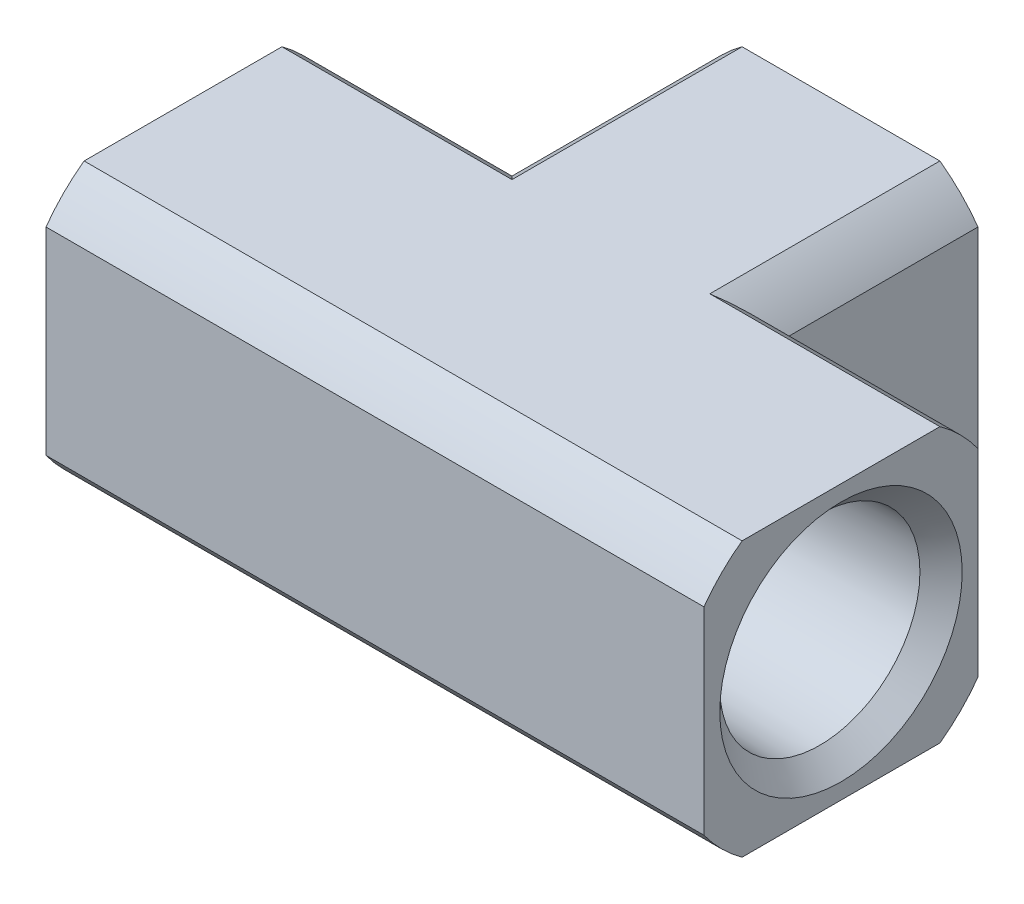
ISO-10303-21;
HEADER;
FILE_DESCRIPTION(('STEP AP214'),'2;1');
FILE_NAME('part.step','',(''),(''),'','','');
FILE_SCHEMA(('AUTOMOTIVE_DESIGN { 1 0 10303 214 1 1 1 1 }'));
ENDSEC;
DATA;
#1=APPLICATION_CONTEXT('core data for automotive mechanical design processes');
#2=APPLICATION_PROTOCOL_DEFINITION('international standard','automotive_design',2000,#1);
#3=PRODUCT_CONTEXT('',#1,'mechanical');
#4=PRODUCT('Part','Part','',(#3));
#5=PRODUCT_RELATED_PRODUCT_CATEGORY('part','',(#4));
#6=PRODUCT_DEFINITION_FORMATION('','',#4);
#7=PRODUCT_DEFINITION_CONTEXT('part definition',#1,'design');
#8=PRODUCT_DEFINITION('design','',#6,#7);
#9=PRODUCT_DEFINITION_SHAPE('','',#8);
#10=(LENGTH_UNIT() NAMED_UNIT(*) SI_UNIT(.MILLI.,.METRE.));
#11=(NAMED_UNIT(*) PLANE_ANGLE_UNIT() SI_UNIT($,.RADIAN.));
#12=(NAMED_UNIT(*) SI_UNIT($,.STERADIAN.) SOLID_ANGLE_UNIT());
#13=UNCERTAINTY_MEASURE_WITH_UNIT(LENGTH_MEASURE(1.E-05),#10,'distance_accuracy_value','');
#14=(GEOMETRIC_REPRESENTATION_CONTEXT(3) GLOBAL_UNCERTAINTY_ASSIGNED_CONTEXT((#13)) GLOBAL_UNIT_ASSIGNED_CONTEXT((#10,
#11,#12)) REPRESENTATION_CONTEXT('',''));
#15=CARTESIAN_POINT('',(0.,0.,0.));
#16=DIRECTION('',(0.,0.,1.));
#17=DIRECTION('',(1.,0.,0.));
#18=AXIS2_PLACEMENT_3D('',#15,#16,#17);
#19=CARTESIAN_POINT('',(5.08,0.,0.));
#20=DIRECTION('',(-1.,0.,0.));
#21=DIRECTION('',(0.,0.,1.));
#22=AXIS2_PLACEMENT_3D('',#19,#20,#21);
#23=CYLINDRICAL_SURFACE('',#22,5.3594);
#24=CARTESIAN_POINT('',(5.08,0.,0.));
#25=DIRECTION('',(-1.,0.,0.));
#26=DIRECTION('',(0.,0.,1.));
#27=AXIS2_PLACEMENT_3D('',#24,#25,#26);
#28=CIRCLE('',#27,5.3594);
#29=CARTESIAN_POINT('',(5.08,1.70785490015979,-5.08));
#30=VERTEX_POINT('',#29);
#31=CARTESIAN_POINT('',(5.08,-1.70785490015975,-5.08));
#32=VERTEX_POINT('',#31);
#33=EDGE_CURVE('E165',#30,#32,#28,.F.);
#34=ORIENTED_EDGE('',*,*,#33,.T.);
#35=CARTESIAN_POINT('',(0.,0.,0.));
#36=DIRECTION('',(-0.707106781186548,0.,-0.707106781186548));
#37=DIRECTION('',(-0.707106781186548,0.,0.707106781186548));
#38=AXIS2_PLACEMENT_3D('',#35,#36,#37);
#39=ELLIPSE('',#38,7.57933616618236,5.3594);
#40=CARTESIAN_POINT('',(0.,-5.3594,0.));
#41=VERTEX_POINT('',#40);
#42=EDGE_CURVE('E196',#32,#41,#39,.T.);
#43=ORIENTED_EDGE('',*,*,#42,.T.);
#44=CARTESIAN_POINT('',(0.,0.,0.));
#45=DIRECTION('',(-0.707106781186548,0.,0.707106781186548));
#46=DIRECTION('',(-0.707106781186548,0.,-0.707106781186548));
#47=AXIS2_PLACEMENT_3D('',#44,#45,#46);
#48=ELLIPSE('',#47,7.57933616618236,5.3594);
#49=CARTESIAN_POINT('',(-5.08,-1.70785490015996,-5.08));
#50=VERTEX_POINT('',#49);
#51=EDGE_CURVE('E160',#41,#50,#48,.F.);
#52=ORIENTED_EDGE('',*,*,#51,.T.);
#53=CARTESIAN_POINT('',(-5.08,0.,0.));
#54=DIRECTION('',(-1.,0.,0.));
#55=DIRECTION('',(0.,0.,1.));
#56=AXIS2_PLACEMENT_3D('',#53,#54,#55);
#57=CIRCLE('',#56,5.3594);
#58=CARTESIAN_POINT('',(-5.08,1.70785490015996,-5.08));
#59=VERTEX_POINT('',#58);
#60=EDGE_CURVE('E156',#50,#59,#57,.T.);
#61=ORIENTED_EDGE('',*,*,#60,.T.);
#62=CARTESIAN_POINT('',(0.,0.,0.));
#63=DIRECTION('',(-0.707106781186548,0.,0.707106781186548));
#64=DIRECTION('',(-0.707106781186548,0.,-0.707106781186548));
#65=AXIS2_PLACEMENT_3D('',#62,#63,#64);
#66=ELLIPSE('',#65,7.57933616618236,5.3594);
#67=CARTESIAN_POINT('',(0.,5.3594,0.));
#68=VERTEX_POINT('',#67);
#69=EDGE_CURVE('E19',#59,#68,#66,.F.);
#70=ORIENTED_EDGE('',*,*,#69,.T.);
#71=CARTESIAN_POINT('',(0.,0.,0.));
#72=DIRECTION('',(-0.707106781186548,0.,-0.707106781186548));
#73=DIRECTION('',(-0.707106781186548,0.,0.707106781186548));
#74=AXIS2_PLACEMENT_3D('',#71,#72,#73);
#75=ELLIPSE('',#74,7.57933616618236,5.3594);
#76=EDGE_CURVE('E174',#68,#30,#75,.T.);
#77=ORIENTED_EDGE('',*,*,#76,.T.);
#78=EDGE_LOOP('',(#34,#43,#52,#61,#70,#77));
#79=FACE_BOUND('',#78,.T.);
#80=ADVANCED_FACE('F15',(#79),#23,.F.);
#81=CARTESIAN_POINT('',(0.,0.,-5.0800000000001));
#82=DIRECTION('',(0.,0.,1.));
#83=DIRECTION('',(1.,0.,0.));
#84=AXIS2_PLACEMENT_3D('',#81,#82,#83);
#85=CYLINDRICAL_SURFACE('',#84,5.3594);
#86=ORIENTED_EDGE('',*,*,#76,.F.);
#87=ORIENTED_EDGE('',*,*,#69,.F.);
#88=CARTESIAN_POINT('',(0.,0.,-5.08));
#89=DIRECTION('',(0.,0.,1.));
#90=DIRECTION('',(1.,0.,0.));
#91=AXIS2_PLACEMENT_3D('',#88,#89,#90);
#92=CIRCLE('',#91,5.3594);
#93=EDGE_CURVE('E172',#59,#30,#92,.F.);
#94=ORIENTED_EDGE('',*,*,#93,.T.);
#95=EDGE_LOOP('',(#86,#87,#94));
#96=FACE_BOUND('',#95,.T.);
#97=ADVANCED_FACE('F170',(#96),#85,.F.);
#98=CARTESIAN_POINT('',(0.,0.,-5.0800000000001));
#99=DIRECTION('',(0.,0.,1.));
#100=DIRECTION('',(1.,0.,0.));
#101=AXIS2_PLACEMENT_3D('',#98,#99,#100);
#102=CYLINDRICAL_SURFACE('',#101,5.3594);
#103=ORIENTED_EDGE('',*,*,#51,.F.);
#104=ORIENTED_EDGE('',*,*,#42,.F.);
#105=CARTESIAN_POINT('',(0.,0.,-5.08));
#106=DIRECTION('',(0.,0.,1.));
#107=DIRECTION('',(1.,0.,0.));
#108=AXIS2_PLACEMENT_3D('',#105,#106,#107);
#109=CIRCLE('',#108,5.3594);
#110=EDGE_CURVE('E192',#32,#50,#109,.F.);
#111=ORIENTED_EDGE('',*,*,#110,.T.);
#112=EDGE_LOOP('',(#103,#104,#111));
#113=FACE_BOUND('',#112,.T.);
#114=ADVANCED_FACE('F211',(#113),#102,.F.);
#115=CARTESIAN_POINT('',(-5.08,0.,0.));
#116=DIRECTION('',(1.,0.,0.));
#117=DIRECTION('',(0.,0.,-1.));
#118=AXIS2_PLACEMENT_3D('',#115,#116,#117);
#119=PLANE('',#118);
#120=DIRECTION('',(0.,-1.,0.));
#121=VECTOR('',#120,1.);
#122=CARTESIAN_POINT('',(-5.08,-3.67310032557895,-5.08));
#123=LINE('',#122,#121);
#124=CARTESIAN_POINT('',(-5.08,-2.3552529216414,-5.08));
#125=VERTEX_POINT('',#124);
#126=EDGE_CURVE('E214',#50,#125,#123,.T.);
#127=ORIENTED_EDGE('',*,*,#126,.T.);
#128=CARTESIAN_POINT('',(-5.08,0.,0.));
#129=DIRECTION('',(1.,0.,0.));
#130=DIRECTION('',(0.,0.,-1.));
#131=AXIS2_PLACEMENT_3D('',#128,#129,#130);
#132=CIRCLE('',#131,5.59943);
#133=CARTESIAN_POINT('',(-5.08,2.35525292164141,-5.08));
#134=VERTEX_POINT('',#133);
#135=EDGE_CURVE('E178',#125,#134,#132,.F.);
#136=ORIENTED_EDGE('',*,*,#135,.T.);
#137=DIRECTION('',(0.,-1.,0.));
#138=VECTOR('',#137,1.);
#139=CARTESIAN_POINT('',(-5.08000000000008,3.6731003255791,-5.08));
#140=LINE('',#139,#138);
#141=EDGE_CURVE('E176',#134,#59,#140,.T.);
#142=ORIENTED_EDGE('',*,*,#141,.T.);
#143=ORIENTED_EDGE('',*,*,#60,.F.);
#144=EDGE_LOOP('',(#127,#136,#142,#143));
#145=FACE_BOUND('',#144,.T.);
#146=ADVANCED_FACE('F177',(#145),#119,.F.);
#147=CARTESIAN_POINT('',(5.08,-5.59943,5.70622429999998));
#148=DIRECTION('',(-1.,0.,0.));
#149=DIRECTION('',(0.,1.,0.));
#150=AXIS2_PLACEMENT_3D('',#147,#148,#149);
#151=PLANE('',#150);
#152=ORIENTED_EDGE('',*,*,#33,.F.);
#153=DIRECTION('',(0.,1.,0.));
#154=VECTOR('',#153,1.);
#155=CARTESIAN_POINT('',(5.08,3.6731003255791,-5.08));
#156=LINE('',#155,#154);
#157=CARTESIAN_POINT('',(5.08,2.3552529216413,-5.08));
#158=VERTEX_POINT('',#157);
#159=EDGE_CURVE('E184',#30,#158,#156,.T.);
#160=ORIENTED_EDGE('',*,*,#159,.T.);
#161=CARTESIAN_POINT('',(5.08,0.,0.));
#162=DIRECTION('',(-1.,0.,0.));
#163=DIRECTION('',(0.,0.,1.));
#164=AXIS2_PLACEMENT_3D('',#161,#162,#163);
#165=CIRCLE('',#164,5.59943);
#166=CARTESIAN_POINT('',(5.08,-2.35525292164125,-5.08));
#167=VERTEX_POINT('',#166);
#168=EDGE_CURVE('E203',#158,#167,#165,.F.);
#169=ORIENTED_EDGE('',*,*,#168,.T.);
#170=DIRECTION('',(0.,1.,0.));
#171=VECTOR('',#170,1.);
#172=CARTESIAN_POINT('',(5.08,-3.67310032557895,-5.08));
#173=LINE('',#172,#171);
#174=EDGE_CURVE('E183',#167,#32,#173,.T.);
#175=ORIENTED_EDGE('',*,*,#174,.T.);
#176=EDGE_LOOP('',(#152,#160,#169,#175));
#177=FACE_BOUND('',#176,.T.);
#178=ADVANCED_FACE('F201',(#177),#151,.F.);
#179=CARTESIAN_POINT('',(5.08,5.63834575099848,-5.08));
#180=DIRECTION('',(0.,0.,1.));
#181=DIRECTION('',(-1.,0.,0.));
#182=AXIS2_PLACEMENT_3D('',#179,#180,#181);
#183=PLANE('',#182);
#184=CARTESIAN_POINT('',(0.,0.,-5.08));
#185=DIRECTION('',(0.,0.,1.));
#186=DIRECTION('',(1.,0.,0.));
#187=AXIS2_PLACEMENT_3D('',#184,#185,#186);
#188=CIRCLE('',#187,5.59943);
#189=EDGE_CURVE('E293',#134,#158,#188,.F.);
#190=ORIENTED_EDGE('',*,*,#189,.T.);
#191=ORIENTED_EDGE('',*,*,#159,.F.);
#192=ORIENTED_EDGE('',*,*,#93,.F.);
#193=ORIENTED_EDGE('',*,*,#141,.F.);
#194=EDGE_LOOP('',(#190,#191,#192,#193));
#195=FACE_BOUND('',#194,.T.);
#196=ADVANCED_FACE('F186',(#195),#183,.F.);
#197=CARTESIAN_POINT('',(5.08,-1.70785490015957,-5.08));
#198=DIRECTION('',(0.,0.,1.));
#199=DIRECTION('',(-1.,0.,0.));
#200=AXIS2_PLACEMENT_3D('',#197,#198,#199);
#201=PLANE('',#200);
#202=ORIENTED_EDGE('',*,*,#110,.F.);
#203=ORIENTED_EDGE('',*,*,#174,.F.);
#204=CARTESIAN_POINT('',(0.,0.,-5.08));
#205=DIRECTION('',(0.,0.,1.));
#206=DIRECTION('',(1.,0.,0.));
#207=AXIS2_PLACEMENT_3D('',#204,#205,#206);
#208=CIRCLE('',#207,5.59943);
#209=EDGE_CURVE('E289',#167,#125,#208,.F.);
#210=ORIENTED_EDGE('',*,*,#209,.T.);
#211=ORIENTED_EDGE('',*,*,#126,.F.);
#212=EDGE_LOOP('',(#202,#203,#210,#211));
#213=FACE_BOUND('',#212,.T.);
#214=ADVANCED_FACE('F213',(#213),#201,.F.);
#215=CARTESIAN_POINT('',(-12.192,0.,0.));
#216=DIRECTION('',(1.,0.,0.));
#217=DIRECTION('',(0.,0.,-1.));
#218=AXIS2_PLACEMENT_3D('',#215,#216,#217);
#219=CYLINDRICAL_SURFACE('',#218,5.59943);
#220=ORIENTED_EDGE('',*,*,#135,.F.);
#221=CARTESIAN_POINT('',(0.,0.,0.));
#222=DIRECTION('',(0.707106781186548,0.,-0.707106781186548));
#223=DIRECTION('',(0.707106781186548,0.,0.707106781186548));
#224=AXIS2_PLACEMENT_3D('',#221,#222,#223);
#225=ELLIPSE('',#224,7.91878984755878,5.59943);
#226=EDGE_CURVE('E287',#125,#134,#225,.T.);
#227=ORIENTED_EDGE('',*,*,#226,.T.);
#228=EDGE_LOOP('',(#220,#227));
#229=FACE_BOUND('',#228,.T.);
#230=CARTESIAN_POINT('',(-9.29340058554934,0.,0.));
#231=DIRECTION('',(-1.,0.,0.));
#232=DIRECTION('',(0.,-1.,0.));
#233=AXIS2_PLACEMENT_3D('',#230,#231,#232);
#234=CIRCLE('',#233,5.59943);
#235=CARTESIAN_POINT('',(-9.29340058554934,-5.59943,0.));
#236=VERTEX_POINT('',#235);
#237=EDGE_CURVE('E217',#236,#236,#234,.T.);
#238=ORIENTED_EDGE('',*,*,#237,.T.);
#239=EDGE_LOOP('',(#238));
#240=FACE_BOUND('',#239,.T.);
#241=ADVANCED_FACE('F303',(#229,#240),#219,.F.);
#242=CARTESIAN_POINT('',(9.29340058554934,0.,0.));
#243=DIRECTION('',(-1.,0.,0.));
#244=DIRECTION('',(0.,0.,1.));
#245=AXIS2_PLACEMENT_3D('',#242,#243,#244);
#246=CYLINDRICAL_SURFACE('',#245,5.59943);
#247=CARTESIAN_POINT('',(0.,0.,0.));
#248=DIRECTION('',(-0.707106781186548,0.,-0.707106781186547));
#249=DIRECTION('',(-0.707106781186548,0.,0.707106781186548));
#250=AXIS2_PLACEMENT_3D('',#247,#248,#249);
#251=ELLIPSE('',#250,7.91878984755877,5.59943);
#252=EDGE_CURVE('E291',#158,#167,#251,.T.);
#253=ORIENTED_EDGE('',*,*,#252,.T.);
#254=ORIENTED_EDGE('',*,*,#168,.F.);
#255=EDGE_LOOP('',(#253,#254));
#256=FACE_BOUND('',#255,.T.);
#257=CARTESIAN_POINT('',(9.29340058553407,0.,0.));
#258=DIRECTION('',(1.,0.,0.));
#259=DIRECTION('',(0.,0.,1.));
#260=AXIS2_PLACEMENT_3D('',#257,#258,#259);
#261=CIRCLE('',#260,5.59943000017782);
#262=CARTESIAN_POINT('',(9.29340058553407,0.,5.59943000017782));
#263=VERTEX_POINT('',#262);
#264=EDGE_CURVE('E310',#263,#263,#261,.T.);
#265=ORIENTED_EDGE('',*,*,#264,.T.);
#266=EDGE_LOOP('',(#265));
#267=FACE_BOUND('',#266,.T.);
#268=ADVANCED_FACE('F298',(#256,#267),#246,.F.);
#269=CARTESIAN_POINT('',(0.,0.,-9.2837));
#270=DIRECTION('',(0.,0.,1.));
#271=DIRECTION('',(1.,0.,0.));
#272=AXIS2_PLACEMENT_3D('',#269,#270,#271);
#273=CYLINDRICAL_SURFACE('',#272,5.59943);
#274=ORIENTED_EDGE('',*,*,#252,.F.);
#275=ORIENTED_EDGE('',*,*,#189,.F.);
#276=ORIENTED_EDGE('',*,*,#226,.F.);
#277=ORIENTED_EDGE('',*,*,#209,.F.);
#278=EDGE_LOOP('',(#274,#275,#276,#277));
#279=FACE_BOUND('',#278,.T.);
#280=CARTESIAN_POINT('',(0.,0.,-9.28369999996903));
#281=DIRECTION('',(0.,0.,-1.));
#282=DIRECTION('',(0.,-1.,0.));
#283=AXIS2_PLACEMENT_3D('',#280,#281,#282);
#284=CIRCLE('',#283,5.59943000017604);
#285=CARTESIAN_POINT('',(0.,-5.59943000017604,-9.28369999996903));
#286=VERTEX_POINT('',#285);
#287=EDGE_CURVE('E312',#286,#286,#284,.T.);
#288=ORIENTED_EDGE('',*,*,#287,.T.);
#289=EDGE_LOOP('',(#288));
#290=FACE_BOUND('',#289,.T.);
#291=ADVANCED_FACE('F300',(#279,#290),#273,.F.);
#292=CARTESIAN_POINT('',(-9.29340058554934,0.,0.));
#293=DIRECTION('',(-1.,0.,0.));
#294=DIRECTION('',(0.,-1.,0.));
#295=AXIS2_PLACEMENT_3D('',#292,#293,#294);
#296=CONICAL_SURFACE('',#295,5.59943,0.0311192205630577);
#297=ORIENTED_EDGE('',*,*,#237,.F.);
#298=EDGE_LOOP('',(#297));
#299=FACE_BOUND('',#298,.T.);
#300=CARTESIAN_POINT('',(-18.0644668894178,0.,0.));
#301=DIRECTION('',(-1.,0.,0.));
#302=DIRECTION('',(0.,0.,1.));
#303=AXIS2_PLACEMENT_3D('',#300,#301,#302);
#304=CIRCLE('',#303,5.87246688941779);
#305=CARTESIAN_POINT('',(-18.0644668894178,0.,5.87246688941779));
#306=VERTEX_POINT('',#305);
#307=EDGE_CURVE('E318',#306,#306,#304,.T.);
#308=ORIENTED_EDGE('',*,*,#307,.T.);
#309=EDGE_LOOP('',(#308));
#310=FACE_BOUND('',#309,.T.);
#311=ADVANCED_FACE('F645',(#299,#310),#296,.F.);
#312=CARTESIAN_POINT('',(18.0644668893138,0.,0.));
#313=DIRECTION('',(1.,0.,0.));
#314=DIRECTION('',(0.,0.,-1.));
#315=AXIS2_PLACEMENT_3D('',#312,#313,#314);
#316=CONICAL_SURFACE('',#315,5.87246688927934,0.0311192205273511);
#317=CARTESIAN_POINT('',(18.0644668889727,0.,0.));
#318=DIRECTION('',(1.,0.,0.));
#319=DIRECTION('',(0.,0.,1.));
#320=AXIS2_PLACEMENT_3D('',#317,#318,#319);
#321=CIRCLE('',#320,5.87246688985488);
#322=CARTESIAN_POINT('',(18.0644668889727,0.,5.87246688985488));
#323=VERTEX_POINT('',#322);
#324=EDGE_CURVE('E322',#323,#323,#321,.T.);
#325=ORIENTED_EDGE('',*,*,#324,.T.);
#326=EDGE_LOOP('',(#325));
#327=FACE_BOUND('',#326,.T.);
#328=ORIENTED_EDGE('',*,*,#264,.F.);
#329=EDGE_LOOP('',(#328));
#330=FACE_BOUND('',#329,.T.);
#331=ADVANCED_FACE('F654',(#327,#330),#316,.F.);
#332=CARTESIAN_POINT('',(0.,0.,-18.0647785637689));
#333=DIRECTION('',(0.,0.,-1.));
#334=DIRECTION('',(-1.,0.,0.));
#335=AXIS2_PLACEMENT_3D('',#332,#333,#334);
#336=CONICAL_SURFACE('',#335,5.87277856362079,0.0311192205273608);
#337=ORIENTED_EDGE('',*,*,#287,.F.);
#338=EDGE_LOOP('',(#337));
#339=FACE_BOUND('',#338,.T.);
#340=CARTESIAN_POINT('',(0.,0.,-18.0647785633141));
#341=DIRECTION('',(0.,0.,-1.));
#342=DIRECTION('',(0.,-1.,0.));
#343=AXIS2_PLACEMENT_3D('',#340,#341,#342);
#344=CIRCLE('',#343,5.87277856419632);
#345=CARTESIAN_POINT('',(0.,-5.87277856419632,-18.0647785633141));
#346=VERTEX_POINT('',#345);
#347=EDGE_CURVE('E325',#346,#346,#344,.T.);
#348=ORIENTED_EDGE('',*,*,#347,.T.);
#349=EDGE_LOOP('',(#348));
#350=FACE_BOUND('',#349,.T.);
#351=ADVANCED_FACE('F662',(#339,#350),#336,.F.);
#352=CARTESIAN_POINT('',(0.,0.,0.));
#353=DIRECTION('',(1.,0.,0.));
#354=DIRECTION('',(0.,0.,-1.));
#355=AXIS2_PLACEMENT_3D('',#352,#353,#354);
#356=CYLINDRICAL_SURFACE('',#355,9.91489);
#357=CARTESIAN_POINT('',(-19.304,0.,0.));
#358=DIRECTION('',(1.,0.,0.));
#359=DIRECTION('',(0.,0.,-1.));
#360=AXIS2_PLACEMENT_3D('',#357,#358,#359);
#361=CIRCLE('',#360,9.91489);
#362=CARTESIAN_POINT('',(-19.304,-8.0391,-5.80326760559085));
#363=VERTEX_POINT('',#362);
#364=CARTESIAN_POINT('',(-19.304,-5.80326760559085,-8.0391));
#365=VERTEX_POINT('',#364);
#366=EDGE_CURVE('E274',#363,#365,#361,.T.);
#367=ORIENTED_EDGE('',*,*,#366,.T.);
#368=DIRECTION('',(-1.,0.,0.));
#369=VECTOR('',#368,1.);
#370=CARTESIAN_POINT('',(0.,-5.80326760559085,-8.0391));
#371=LINE('',#370,#369);
#372=CARTESIAN_POINT('',(-8.0391,-5.80326760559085,-8.0391));
#373=VERTEX_POINT('',#372);
#374=EDGE_CURVE('E315',#373,#365,#371,.T.);
#375=ORIENTED_EDGE('',*,*,#374,.F.);
#376=CARTESIAN_POINT('',(0.,0.,0.));
#377=DIRECTION('',(0.707106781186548,0.,-0.707106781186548));
#378=DIRECTION('',(0.707106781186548,0.,0.707106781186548));
#379=AXIS2_PLACEMENT_3D('',#376,#377,#378);
#380=ELLIPSE('',#379,14.0217719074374,9.91489);
#381=CARTESIAN_POINT('',(-5.80326760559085,-8.0391,-5.80326760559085));
#382=VERTEX_POINT('',#381);
#383=EDGE_CURVE('E282',#382,#373,#380,.T.);
#384=ORIENTED_EDGE('',*,*,#383,.F.);
#385=DIRECTION('',(1.,0.,0.));
#386=VECTOR('',#385,1.);
#387=CARTESIAN_POINT('',(0.,-8.0391,-5.80326760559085));
#388=LINE('',#387,#386);
#389=EDGE_CURVE('E330',#363,#382,#388,.T.);
#390=ORIENTED_EDGE('',*,*,#389,.F.);
#391=EDGE_LOOP('',(#367,#375,#384,#390));
#392=FACE_BOUND('',#391,.T.);
#393=ADVANCED_FACE('F413',(#392),#356,.T.);
#394=CARTESIAN_POINT('',(0.,5.80326760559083,-8.0391));
#395=DIRECTION('',(0.,0.,-1.));
#396=DIRECTION('',(-1.,0.,0.));
#397=AXIS2_PLACEMENT_3D('',#394,#395,#396);
#398=PLANE('',#397);
#399=DIRECTION('',(0.,1.,0.));
#400=VECTOR('',#399,1.);
#401=CARTESIAN_POINT('',(-19.304,0.,-8.0391));
#402=LINE('',#401,#400);
#403=CARTESIAN_POINT('',(-19.304,5.80326760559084,-8.0391));
#404=VERTEX_POINT('',#403);
#405=EDGE_CURVE('E273',#365,#404,#402,.T.);
#406=ORIENTED_EDGE('',*,*,#405,.T.);
#407=DIRECTION('',(1.,0.,0.));
#408=VECTOR('',#407,1.);
#409=CARTESIAN_POINT('',(0.,5.80326760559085,-8.0391));
#410=LINE('',#409,#408);
#411=CARTESIAN_POINT('',(-8.0391,5.80326760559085,-8.0391));
#412=VERTEX_POINT('',#411);
#413=EDGE_CURVE('E349',#412,#404,#410,.F.);
#414=ORIENTED_EDGE('',*,*,#413,.F.);
#415=DIRECTION('',(0.,1.,0.));
#416=VECTOR('',#415,1.);
#417=CARTESIAN_POINT('',(-8.0391,5.80326760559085,-8.0391));
#418=LINE('',#417,#416);
#419=EDGE_CURVE('E328',#373,#412,#418,.T.);
#420=ORIENTED_EDGE('',*,*,#419,.F.);
#421=ORIENTED_EDGE('',*,*,#374,.T.);
#422=EDGE_LOOP('',(#406,#414,#420,#421));
#423=FACE_BOUND('',#422,.T.);
#424=ADVANCED_FACE('F407',(#423),#398,.T.);
#425=CARTESIAN_POINT('',(-18.0644668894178,0.,0.));
#426=DIRECTION('',(-1.,0.,0.));
#427=DIRECTION('',(0.,0.,1.));
#428=AXIS2_PLACEMENT_3D('',#425,#426,#427);
#429=CONICAL_SURFACE('',#428,5.87246688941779,0.785398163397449);
#430=ORIENTED_EDGE('',*,*,#307,.F.);
#431=EDGE_LOOP('',(#430));
#432=FACE_BOUND('',#431,.T.);
#433=CARTESIAN_POINT('',(-19.304,0.,0.));
#434=DIRECTION('',(-1.,0.,0.));
#435=DIRECTION('',(0.,0.,1.));
#436=AXIS2_PLACEMENT_3D('',#433,#434,#435);
#437=CIRCLE('',#436,7.112);
#438=CARTESIAN_POINT('',(-19.304,0.,7.112));
#439=VERTEX_POINT('',#438);
#440=EDGE_CURVE('E264',#439,#439,#437,.T.);
#441=ORIENTED_EDGE('',*,*,#440,.T.);
#442=EDGE_LOOP('',(#441));
#443=FACE_BOUND('',#442,.T.);
#444=ADVANCED_FACE('F17',(#432,#443),#429,.F.);
#445=CARTESIAN_POINT('',(0.,-5.80326760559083,8.0391));
#446=DIRECTION('',(0.,0.,1.));
#447=DIRECTION('',(1.,0.,0.));
#448=AXIS2_PLACEMENT_3D('',#445,#446,#447);
#449=PLANE('',#448);
#450=DIRECTION('',(0.,1.,0.));
#451=VECTOR('',#450,1.);
#452=CARTESIAN_POINT('',(-19.304,0.,8.0391));
#453=LINE('',#452,#451);
#454=CARTESIAN_POINT('',(-19.304,5.80326760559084,8.0391));
#455=VERTEX_POINT('',#454);
#456=CARTESIAN_POINT('',(-19.304,-5.80326760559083,8.0391));
#457=VERTEX_POINT('',#456);
#458=EDGE_CURVE('E270',#455,#457,#453,.F.);
#459=ORIENTED_EDGE('',*,*,#458,.T.);
#460=DIRECTION('',(1.,0.,0.));
#461=VECTOR('',#460,1.);
#462=CARTESIAN_POINT('',(0.,-5.80326760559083,8.0391));
#463=LINE('',#462,#461);
#464=CARTESIAN_POINT('',(19.304,-5.80326760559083,8.0391));
#465=VERTEX_POINT('',#464);
#466=EDGE_CURVE('E321',#465,#457,#463,.F.);
#467=ORIENTED_EDGE('',*,*,#466,.F.);
#468=DIRECTION('',(0.,1.,0.));
#469=VECTOR('',#468,1.);
#470=CARTESIAN_POINT('',(19.304,0.,8.0391));
#471=LINE('',#470,#469);
#472=CARTESIAN_POINT('',(19.304,5.80326760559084,8.0391));
#473=VERTEX_POINT('',#472);
#474=EDGE_CURVE('E256',#473,#465,#471,.F.);
#475=ORIENTED_EDGE('',*,*,#474,.F.);
#476=DIRECTION('',(1.,0.,0.));
#477=VECTOR('',#476,1.);
#478=CARTESIAN_POINT('',(0.,5.80326760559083,8.0391));
#479=LINE('',#478,#477);
#480=EDGE_CURVE('E260',#455,#473,#479,.T.);
#481=ORIENTED_EDGE('',*,*,#480,.F.);
#482=EDGE_LOOP('',(#459,#467,#475,#481));
#483=FACE_BOUND('',#482,.T.);
#484=ADVANCED_FACE('F450',(#483),#449,.T.);
#485=CARTESIAN_POINT('',(0.,0.,0.));
#486=DIRECTION('',(1.,0.,0.));
#487=DIRECTION('',(0.,0.,-1.));
#488=AXIS2_PLACEMENT_3D('',#485,#486,#487);
#489=CYLINDRICAL_SURFACE('',#488,9.91489);
#490=CARTESIAN_POINT('',(-19.304,0.,0.));
#491=DIRECTION('',(1.,0.,0.));
#492=DIRECTION('',(0.,0.,-1.));
#493=AXIS2_PLACEMENT_3D('',#490,#491,#492);
#494=CIRCLE('',#493,9.91489);
#495=CARTESIAN_POINT('',(-19.304,-8.0391,5.80326760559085));
#496=VERTEX_POINT('',#495);
#497=EDGE_CURVE('E267',#457,#496,#494,.T.);
#498=ORIENTED_EDGE('',*,*,#497,.T.);
#499=DIRECTION('',(1.,0.,0.));
#500=VECTOR('',#499,1.);
#501=CARTESIAN_POINT('',(0.,-8.0391,5.80326760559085));
#502=LINE('',#501,#500);
#503=CARTESIAN_POINT('',(19.304,-8.0391,5.80326760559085));
#504=VERTEX_POINT('',#503);
#505=EDGE_CURVE('E333',#504,#496,#502,.F.);
#506=ORIENTED_EDGE('',*,*,#505,.F.);
#507=CARTESIAN_POINT('',(19.304,0.,0.));
#508=DIRECTION('',(1.,0.,0.));
#509=DIRECTION('',(0.,0.,-1.));
#510=AXIS2_PLACEMENT_3D('',#507,#508,#509);
#511=CIRCLE('',#510,9.91489);
#512=EDGE_CURVE('E253',#465,#504,#511,.T.);
#513=ORIENTED_EDGE('',*,*,#512,.F.);
#514=ORIENTED_EDGE('',*,*,#466,.T.);
#515=EDGE_LOOP('',(#498,#506,#513,#514));
#516=FACE_BOUND('',#515,.T.);
#517=ADVANCED_FACE('F445',(#516),#489,.T.);
#518=CARTESIAN_POINT('',(0.,0.,0.));
#519=DIRECTION('',(1.,0.,0.));
#520=DIRECTION('',(0.,0.,-1.));
#521=AXIS2_PLACEMENT_3D('',#518,#519,#520);
#522=CYLINDRICAL_SURFACE('',#521,9.91489);
#523=CARTESIAN_POINT('',(19.304,0.,0.));
#524=DIRECTION('',(1.,0.,0.));
#525=DIRECTION('',(0.,0.,-1.));
#526=AXIS2_PLACEMENT_3D('',#523,#524,#525);
#527=CIRCLE('',#526,9.91489);
#528=CARTESIAN_POINT('',(19.304,-8.0391,-5.80326760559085));
#529=VERTEX_POINT('',#528);
#530=CARTESIAN_POINT('',(19.304,-5.80326760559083,-8.0391));
#531=VERTEX_POINT('',#530);
#532=EDGE_CURVE('E249',#529,#531,#527,.T.);
#533=ORIENTED_EDGE('',*,*,#532,.F.);
#534=DIRECTION('',(1.,0.,0.));
#535=VECTOR('',#534,1.);
#536=CARTESIAN_POINT('',(0.,-8.0391,-5.80326760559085));
#537=LINE('',#536,#535);
#538=CARTESIAN_POINT('',(5.80326760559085,-8.0391,-5.80326760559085));
#539=VERTEX_POINT('',#538);
#540=EDGE_CURVE('E285',#539,#529,#537,.T.);
#541=ORIENTED_EDGE('',*,*,#540,.F.);
#542=CARTESIAN_POINT('',(0.,0.,0.));
#543=DIRECTION('',(0.707106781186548,0.,0.707106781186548));
#544=DIRECTION('',(0.707106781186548,0.,-0.707106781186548));
#545=AXIS2_PLACEMENT_3D('',#542,#543,#544);
#546=ELLIPSE('',#545,14.0217719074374,9.91489);
#547=CARTESIAN_POINT('',(8.0391,-5.80326760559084,-8.0391));
#548=VERTEX_POINT('',#547);
#549=EDGE_CURVE('E277',#548,#539,#546,.F.);
#550=ORIENTED_EDGE('',*,*,#549,.F.);
#551=DIRECTION('',(-1.,0.,0.));
#552=VECTOR('',#551,1.);
#553=CARTESIAN_POINT('',(0.,-5.80326760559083,-8.0391));
#554=LINE('',#553,#552);
#555=EDGE_CURVE('E286',#531,#548,#554,.T.);
#556=ORIENTED_EDGE('',*,*,#555,.F.);
#557=EDGE_LOOP('',(#533,#541,#550,#556));
#558=FACE_BOUND('',#557,.T.);
#559=ADVANCED_FACE('F465',(#558),#522,.T.);
#560=CARTESIAN_POINT('',(19.3040000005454,0.,0.));
#561=DIRECTION('',(1.,0.,0.));
#562=DIRECTION('',(0.,0.,-1.));
#563=AXIS2_PLACEMENT_3D('',#560,#561,#562);
#564=CONICAL_SURFACE('',#563,7.11199999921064,0.785398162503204);
#565=CARTESIAN_POINT('',(19.3040000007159,0.,0.));
#566=DIRECTION('',(1.,0.,0.));
#567=DIRECTION('',(0.,0.,-1.));
#568=AXIS2_PLACEMENT_3D('',#565,#566,#567);
#569=CIRCLE('',#568,7.11199999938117);
#570=CARTESIAN_POINT('',(19.3040000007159,0.,-7.11199999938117));
#571=VERTEX_POINT('',#570);
#572=EDGE_CURVE('E245',#571,#571,#569,.F.);
#573=ORIENTED_EDGE('',*,*,#572,.F.);
#574=EDGE_LOOP('',(#573));
#575=FACE_BOUND('',#574,.T.);
#576=ORIENTED_EDGE('',*,*,#324,.F.);
#577=EDGE_LOOP('',(#576));
#578=FACE_BOUND('',#577,.T.);
#579=ADVANCED_FACE('F467',(#575,#578),#564,.F.);
#580=CARTESIAN_POINT('',(0.,5.80326760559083,-8.0391));
#581=DIRECTION('',(0.,0.,-1.));
#582=DIRECTION('',(-1.,0.,0.));
#583=AXIS2_PLACEMENT_3D('',#580,#581,#582);
#584=PLANE('',#583);
#585=DIRECTION('',(0.,1.,0.));
#586=VECTOR('',#585,1.);
#587=CARTESIAN_POINT('',(19.304,0.,-8.0391));
#588=LINE('',#587,#586);
#589=CARTESIAN_POINT('',(19.304,5.80326760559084,-8.0391));
#590=VERTEX_POINT('',#589);
#591=EDGE_CURVE('E248',#531,#590,#588,.T.);
#592=ORIENTED_EDGE('',*,*,#591,.F.);
#593=ORIENTED_EDGE('',*,*,#555,.T.);
#594=DIRECTION('',(0.,1.,0.));
#595=VECTOR('',#594,1.);
#596=CARTESIAN_POINT('',(8.0391,-5.80326760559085,-8.0391));
#597=LINE('',#596,#595);
#598=CARTESIAN_POINT('',(8.0391,5.80326760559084,-8.0391));
#599=VERTEX_POINT('',#598);
#600=EDGE_CURVE('E343',#599,#548,#597,.F.);
#601=ORIENTED_EDGE('',*,*,#600,.F.);
#602=DIRECTION('',(1.,0.,0.));
#603=VECTOR('',#602,1.);
#604=CARTESIAN_POINT('',(0.,5.80326760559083,-8.0391));
#605=LINE('',#604,#603);
#606=EDGE_CURVE('E241',#590,#599,#605,.F.);
#607=ORIENTED_EDGE('',*,*,#606,.F.);
#608=EDGE_LOOP('',(#592,#593,#601,#607));
#609=FACE_BOUND('',#608,.T.);
#610=ADVANCED_FACE('F462',(#609),#584,.T.);
#611=CARTESIAN_POINT('',(0.,0.,0.));
#612=DIRECTION('',(0.,0.,-1.));
#613=DIRECTION('',(-1.,0.,0.));
#614=AXIS2_PLACEMENT_3D('',#611,#612,#613);
#615=CYLINDRICAL_SURFACE('',#614,9.91489);
#616=CARTESIAN_POINT('',(0.,0.,-19.304));
#617=DIRECTION('',(0.,0.,-1.));
#618=DIRECTION('',(-1.,0.,0.));
#619=AXIS2_PLACEMENT_3D('',#616,#617,#618);
#620=CIRCLE('',#619,9.91489);
#621=CARTESIAN_POINT('',(-8.0391,-5.80326760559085,-19.304));
#622=VERTEX_POINT('',#621);
#623=CARTESIAN_POINT('',(-5.80326760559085,-8.0391,-19.304));
#624=VERTEX_POINT('',#623);
#625=EDGE_CURVE('E234',#622,#624,#620,.F.);
#626=ORIENTED_EDGE('',*,*,#625,.T.);
#627=DIRECTION('',(0.,0.,-1.));
#628=VECTOR('',#627,1.);
#629=CARTESIAN_POINT('',(-5.80326760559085,-8.0391,-5.80326760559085));
#630=LINE('',#629,#628);
#631=EDGE_CURVE('E281',#382,#624,#630,.T.);
#632=ORIENTED_EDGE('',*,*,#631,.F.);
#633=ORIENTED_EDGE('',*,*,#383,.T.);
#634=DIRECTION('',(0.,0.,1.));
#635=VECTOR('',#634,1.);
#636=CARTESIAN_POINT('',(-8.0391,-5.80326760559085,0.));
#637=LINE('',#636,#635);
#638=EDGE_CURVE('E346',#622,#373,#637,.T.);
#639=ORIENTED_EDGE('',*,*,#638,.F.);
#640=EDGE_LOOP('',(#626,#632,#633,#639));
#641=FACE_BOUND('',#640,.T.);
#642=ADVANCED_FACE('F411',(#641),#615,.T.);
#643=CARTESIAN_POINT('',(0.,-8.0391,-5.80326760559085));
#644=DIRECTION('',(0.,-1.,0.));
#645=DIRECTION('',(0.,0.,-1.));
#646=AXIS2_PLACEMENT_3D('',#643,#644,#645);
#647=PLANE('',#646);
#648=DIRECTION('',(1.,0.,0.));
#649=VECTOR('',#648,1.);
#650=CARTESIAN_POINT('',(0.,-8.0391,-19.304));
#651=LINE('',#650,#649);
#652=CARTESIAN_POINT('',(5.80326760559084,-8.0391,-19.304));
#653=VERTEX_POINT('',#652);
#654=EDGE_CURVE('E233',#624,#653,#651,.T.);
#655=ORIENTED_EDGE('',*,*,#654,.T.);
#656=DIRECTION('',(0.,0.,-1.));
#657=VECTOR('',#656,1.);
#658=CARTESIAN_POINT('',(5.80326760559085,-8.0391,0.));
#659=LINE('',#658,#657);
#660=EDGE_CURVE('E280',#539,#653,#659,.T.);
#661=ORIENTED_EDGE('',*,*,#660,.F.);
#662=ORIENTED_EDGE('',*,*,#540,.T.);
#663=DIRECTION('',(0.,0.,-1.));
#664=VECTOR('',#663,1.);
#665=CARTESIAN_POINT('',(19.304,-8.0391,0.));
#666=LINE('',#665,#664);
#667=EDGE_CURVE('E252',#504,#529,#666,.T.);
#668=ORIENTED_EDGE('',*,*,#667,.F.);
#669=ORIENTED_EDGE('',*,*,#505,.T.);
#670=DIRECTION('',(0.,0.,-1.));
#671=VECTOR('',#670,1.);
#672=CARTESIAN_POINT('',(-19.304,-8.0391,0.));
#673=LINE('',#672,#671);
#674=EDGE_CURVE('E276',#496,#363,#673,.T.);
#675=ORIENTED_EDGE('',*,*,#674,.T.);
#676=ORIENTED_EDGE('',*,*,#389,.T.);
#677=ORIENTED_EDGE('',*,*,#631,.T.);
#678=EDGE_LOOP('',(#655,#661,#662,#668,#669,#675,#676,#677));
#679=FACE_BOUND('',#678,.T.);
#680=ADVANCED_FACE('F441',(#679),#647,.T.);
#681=CARTESIAN_POINT('',(0.,0.,0.));
#682=DIRECTION('',(0.,0.,-1.));
#683=DIRECTION('',(-1.,0.,0.));
#684=AXIS2_PLACEMENT_3D('',#681,#682,#683);
#685=CYLINDRICAL_SURFACE('',#684,9.91489);
#686=CARTESIAN_POINT('',(0.,0.,-19.304));
#687=DIRECTION('',(0.,0.,-1.));
#688=DIRECTION('',(-1.,0.,0.));
#689=AXIS2_PLACEMENT_3D('',#686,#687,#688);
#690=CIRCLE('',#689,9.91489);
#691=CARTESIAN_POINT('',(8.0391,-5.80326760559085,-19.304));
#692=VERTEX_POINT('',#691);
#693=EDGE_CURVE('E231',#653,#692,#690,.F.);
#694=ORIENTED_EDGE('',*,*,#693,.T.);
#695=DIRECTION('',(0.,0.,-1.));
#696=VECTOR('',#695,1.);
#697=CARTESIAN_POINT('',(8.0391,-5.80326760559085,0.));
#698=LINE('',#697,#696);
#699=EDGE_CURVE('E329',#548,#692,#698,.T.);
#700=ORIENTED_EDGE('',*,*,#699,.F.);
#701=ORIENTED_EDGE('',*,*,#549,.T.);
#702=ORIENTED_EDGE('',*,*,#660,.T.);
#703=EDGE_LOOP('',(#694,#700,#701,#702));
#704=FACE_BOUND('',#703,.T.);
#705=ADVANCED_FACE('F437',(#704),#685,.T.);
#706=CARTESIAN_POINT('',(8.0391,-5.80326760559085,0.));
#707=DIRECTION('',(1.,0.,0.));
#708=DIRECTION('',(0.,0.,-1.));
#709=AXIS2_PLACEMENT_3D('',#706,#707,#708);
#710=PLANE('',#709);
#711=DIRECTION('',(0.,1.,0.));
#712=VECTOR('',#711,1.);
#713=CARTESIAN_POINT('',(8.0391,0.,-19.304));
#714=LINE('',#713,#712);
#715=CARTESIAN_POINT('',(8.0391,5.80326760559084,-19.304));
#716=VERTEX_POINT('',#715);
#717=EDGE_CURVE('E230',#692,#716,#714,.T.);
#718=ORIENTED_EDGE('',*,*,#717,.T.);
#719=DIRECTION('',(0.,0.,-1.));
#720=VECTOR('',#719,1.);
#721=CARTESIAN_POINT('',(8.0391,5.80326760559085,0.));
#722=LINE('',#721,#720);
#723=EDGE_CURVE('E240',#599,#716,#722,.T.);
#724=ORIENTED_EDGE('',*,*,#723,.F.);
#725=ORIENTED_EDGE('',*,*,#600,.T.);
#726=ORIENTED_EDGE('',*,*,#699,.T.);
#727=EDGE_LOOP('',(#718,#724,#725,#726));
#728=FACE_BOUND('',#727,.T.);
#729=ADVANCED_FACE('F434',(#728),#710,.T.);
#730=CARTESIAN_POINT('',(0.,0.,-19.3040000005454));
#731=DIRECTION('',(0.,0.,-1.));
#732=DIRECTION('',(-1.,0.,0.));
#733=AXIS2_PLACEMENT_3D('',#730,#731,#732);
#734=CONICAL_SURFACE('',#733,7.11199999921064,0.785398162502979);
#735=ORIENTED_EDGE('',*,*,#347,.F.);
#736=EDGE_LOOP('',(#735));
#737=FACE_BOUND('',#736,.T.);
#738=CARTESIAN_POINT('',(0.,0.,-19.3040000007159));
#739=DIRECTION('',(0.,0.,-1.));
#740=DIRECTION('',(-1.,0.,0.));
#741=AXIS2_PLACEMENT_3D('',#738,#739,#740);
#742=CIRCLE('',#741,7.11199999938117);
#743=CARTESIAN_POINT('',(-7.11199999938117,0.,-19.3040000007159));
#744=VERTEX_POINT('',#743);
#745=EDGE_CURVE('E225',#744,#744,#742,.T.);
#746=ORIENTED_EDGE('',*,*,#745,.T.);
#747=EDGE_LOOP('',(#746));
#748=FACE_BOUND('',#747,.T.);
#749=ADVANCED_FACE('F505',(#737,#748),#734,.F.);
#750=CARTESIAN_POINT('',(-8.0391,5.80326760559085,0.));
#751=DIRECTION('',(-1.,0.,0.));
#752=DIRECTION('',(0.,0.,1.));
#753=AXIS2_PLACEMENT_3D('',#750,#751,#752);
#754=PLANE('',#753);
#755=DIRECTION('',(0.,1.,0.));
#756=VECTOR('',#755,1.);
#757=CARTESIAN_POINT('',(-8.0391,0.,-19.304));
#758=LINE('',#757,#756);
#759=CARTESIAN_POINT('',(-8.0391,5.80326760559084,-19.304));
#760=VERTEX_POINT('',#759);
#761=EDGE_CURVE('E236',#760,#622,#758,.F.);
#762=ORIENTED_EDGE('',*,*,#761,.T.);
#763=ORIENTED_EDGE('',*,*,#638,.T.);
#764=ORIENTED_EDGE('',*,*,#419,.T.);
#765=DIRECTION('',(0.,0.,-1.));
#766=VECTOR('',#765,1.);
#767=CARTESIAN_POINT('',(-8.0391,5.80326760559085,0.));
#768=LINE('',#767,#766);
#769=EDGE_CURVE('E221',#760,#412,#768,.F.);
#770=ORIENTED_EDGE('',*,*,#769,.F.);
#771=EDGE_LOOP('',(#762,#763,#764,#770));
#772=FACE_BOUND('',#771,.T.);
#773=ADVANCED_FACE('F403',(#772),#754,.T.);
#774=CARTESIAN_POINT('',(0.,0.,0.));
#775=DIRECTION('',(1.,0.,0.));
#776=DIRECTION('',(0.,0.,-1.));
#777=AXIS2_PLACEMENT_3D('',#774,#775,#776);
#778=CYLINDRICAL_SURFACE('',#777,9.91489);
#779=CARTESIAN_POINT('',(-19.304,0.,0.));
#780=DIRECTION('',(1.,0.,0.));
#781=DIRECTION('',(0.,0.,-1.));
#782=AXIS2_PLACEMENT_3D('',#779,#780,#781);
#783=CIRCLE('',#782,9.91489);
#784=CARTESIAN_POINT('',(-19.304,8.0391,-5.80326760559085));
#785=VERTEX_POINT('',#784);
#786=EDGE_CURVE('E271',#404,#785,#783,.T.);
#787=ORIENTED_EDGE('',*,*,#786,.T.);
#788=DIRECTION('',(1.,0.,0.));
#789=VECTOR('',#788,1.);
#790=CARTESIAN_POINT('',(0.,8.0391,-5.80326760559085));
#791=LINE('',#790,#789);
#792=CARTESIAN_POINT('',(-5.80326760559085,8.0391,-5.80326760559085));
#793=VERTEX_POINT('',#792);
#794=EDGE_CURVE('E368',#793,#785,#791,.F.);
#795=ORIENTED_EDGE('',*,*,#794,.F.);
#796=CARTESIAN_POINT('',(0.,0.,0.));
#797=DIRECTION('',(0.707106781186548,0.,-0.707106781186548));
#798=DIRECTION('',(0.707106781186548,0.,0.707106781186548));
#799=AXIS2_PLACEMENT_3D('',#796,#797,#798);
#800=ELLIPSE('',#799,14.0217719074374,9.91489);
#801=EDGE_CURVE('E222',#412,#793,#800,.T.);
#802=ORIENTED_EDGE('',*,*,#801,.F.);
#803=ORIENTED_EDGE('',*,*,#413,.T.);
#804=EDGE_LOOP('',(#787,#795,#802,#803));
#805=FACE_BOUND('',#804,.T.);
#806=ADVANCED_FACE('F422',(#805),#778,.T.);
#807=CARTESIAN_POINT('',(-19.304,0.,0.));
#808=DIRECTION('',(1.,0.,0.));
#809=DIRECTION('',(0.,0.,-1.));
#810=AXIS2_PLACEMENT_3D('',#807,#808,#809);
#811=PLANE('',#810);
#812=ORIENTED_EDGE('',*,*,#440,.F.);
#813=EDGE_LOOP('',(#812));
#814=FACE_BOUND('',#813,.T.);
#815=ORIENTED_EDGE('',*,*,#458,.F.);
#816=CARTESIAN_POINT('',(-19.304,0.,0.));
#817=DIRECTION('',(1.,0.,0.));
#818=DIRECTION('',(0.,0.,-1.));
#819=AXIS2_PLACEMENT_3D('',#816,#817,#818);
#820=CIRCLE('',#819,9.91489);
#821=CARTESIAN_POINT('',(-19.304,8.0391,5.80326760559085));
#822=VERTEX_POINT('',#821);
#823=EDGE_CURVE('E261',#822,#455,#820,.T.);
#824=ORIENTED_EDGE('',*,*,#823,.F.);
#825=DIRECTION('',(0.,0.,1.));
#826=VECTOR('',#825,1.);
#827=CARTESIAN_POINT('',(-19.304,8.0391,5.80326760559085));
#828=LINE('',#827,#826);
#829=EDGE_CURVE('E364',#785,#822,#828,.T.);
#830=ORIENTED_EDGE('',*,*,#829,.F.);
#831=ORIENTED_EDGE('',*,*,#786,.F.);
#832=ORIENTED_EDGE('',*,*,#405,.F.);
#833=ORIENTED_EDGE('',*,*,#366,.F.);
#834=ORIENTED_EDGE('',*,*,#674,.F.);
#835=ORIENTED_EDGE('',*,*,#497,.F.);
#836=EDGE_LOOP('',(#815,#824,#830,#831,#832,#833,#834,#835));
#837=FACE_BOUND('',#836,.T.);
#838=ADVANCED_FACE('F417',(#814,#837),#811,.F.);
#839=CARTESIAN_POINT('',(0.,0.,0.));
#840=DIRECTION('',(1.,0.,0.));
#841=DIRECTION('',(0.,0.,-1.));
#842=AXIS2_PLACEMENT_3D('',#839,#840,#841);
#843=CYLINDRICAL_SURFACE('',#842,9.91489);
#844=ORIENTED_EDGE('',*,*,#823,.T.);
#845=ORIENTED_EDGE('',*,*,#480,.T.);
#846=CARTESIAN_POINT('',(19.304,0.,0.));
#847=DIRECTION('',(1.,0.,0.));
#848=DIRECTION('',(0.,0.,-1.));
#849=AXIS2_PLACEMENT_3D('',#846,#847,#848);
#850=CIRCLE('',#849,9.91489);
#851=CARTESIAN_POINT('',(19.304,8.0391,5.80326760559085));
#852=VERTEX_POINT('',#851);
#853=EDGE_CURVE('E257',#852,#473,#850,.T.);
#854=ORIENTED_EDGE('',*,*,#853,.F.);
#855=DIRECTION('',(1.,0.,0.));
#856=VECTOR('',#855,1.);
#857=CARTESIAN_POINT('',(0.,8.0391,5.80326760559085));
#858=LINE('',#857,#856);
#859=EDGE_CURVE('E367',#822,#852,#858,.T.);
#860=ORIENTED_EDGE('',*,*,#859,.F.);
#861=EDGE_LOOP('',(#844,#845,#854,#860));
#862=FACE_BOUND('',#861,.T.);
#863=ADVANCED_FACE('F452',(#862),#843,.T.);
#864=CARTESIAN_POINT('',(19.304,0.,0.));
#865=DIRECTION('',(1.,0.,0.));
#866=DIRECTION('',(0.,0.,-1.));
#867=AXIS2_PLACEMENT_3D('',#864,#865,#866);
#868=PLANE('',#867);
#869=ORIENTED_EDGE('',*,*,#572,.T.);
#870=EDGE_LOOP('',(#869));
#871=FACE_BOUND('',#870,.T.);
#872=CARTESIAN_POINT('',(19.304,0.,0.));
#873=DIRECTION('',(1.,0.,0.));
#874=DIRECTION('',(0.,0.,-1.));
#875=AXIS2_PLACEMENT_3D('',#872,#873,#874);
#876=CIRCLE('',#875,9.91489);
#877=CARTESIAN_POINT('',(19.304,8.0391,-5.80326760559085));
#878=VERTEX_POINT('',#877);
#879=EDGE_CURVE('E242',#878,#590,#876,.F.);
#880=ORIENTED_EDGE('',*,*,#879,.F.);
#881=DIRECTION('',(0.,0.,1.));
#882=VECTOR('',#881,1.);
#883=CARTESIAN_POINT('',(19.304,8.0391,5.80326760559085));
#884=LINE('',#883,#882);
#885=EDGE_CURVE('E371',#852,#878,#884,.F.);
#886=ORIENTED_EDGE('',*,*,#885,.F.);
#887=ORIENTED_EDGE('',*,*,#853,.T.);
#888=ORIENTED_EDGE('',*,*,#474,.T.);
#889=ORIENTED_EDGE('',*,*,#512,.T.);
#890=ORIENTED_EDGE('',*,*,#667,.T.);
#891=ORIENTED_EDGE('',*,*,#532,.T.);
#892=ORIENTED_EDGE('',*,*,#591,.T.);
#893=EDGE_LOOP('',(#880,#886,#887,#888,#889,#890,#891,#892));
#894=FACE_BOUND('',#893,.T.);
#895=ADVANCED_FACE('F456',(#871,#894),#868,.T.);
#896=CARTESIAN_POINT('',(0.,0.,0.));
#897=DIRECTION('',(1.,0.,0.));
#898=DIRECTION('',(0.,0.,-1.));
#899=AXIS2_PLACEMENT_3D('',#896,#897,#898);
#900=CYLINDRICAL_SURFACE('',#899,9.91489);
#901=ORIENTED_EDGE('',*,*,#879,.T.);
#902=ORIENTED_EDGE('',*,*,#606,.T.);
#903=CARTESIAN_POINT('',(0.,0.,0.));
#904=DIRECTION('',(0.707106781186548,0.,0.707106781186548));
#905=DIRECTION('',(0.707106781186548,0.,-0.707106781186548));
#906=AXIS2_PLACEMENT_3D('',#903,#904,#905);
#907=ELLIPSE('',#906,14.0217719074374,9.91489);
#908=CARTESIAN_POINT('',(5.80326760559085,8.0391,-5.80326760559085));
#909=VERTEX_POINT('',#908);
#910=EDGE_CURVE('E237',#909,#599,#907,.F.);
#911=ORIENTED_EDGE('',*,*,#910,.F.);
#912=DIRECTION('',(1.,0.,0.));
#913=VECTOR('',#912,1.);
#914=CARTESIAN_POINT('',(0.,8.0391,-5.80326760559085));
#915=LINE('',#914,#913);
#916=EDGE_CURVE('E379',#878,#909,#915,.F.);
#917=ORIENTED_EDGE('',*,*,#916,.F.);
#918=EDGE_LOOP('',(#901,#902,#911,#917));
#919=FACE_BOUND('',#918,.T.);
#920=ADVANCED_FACE('F460',(#919),#900,.T.);
#921=CARTESIAN_POINT('',(0.,0.,0.));
#922=DIRECTION('',(0.,0.,-1.));
#923=DIRECTION('',(-1.,0.,0.));
#924=AXIS2_PLACEMENT_3D('',#921,#922,#923);
#925=CYLINDRICAL_SURFACE('',#924,9.91489);
#926=CARTESIAN_POINT('',(0.,0.,-19.304));
#927=DIRECTION('',(0.,0.,-1.));
#928=DIRECTION('',(-1.,0.,0.));
#929=AXIS2_PLACEMENT_3D('',#926,#927,#928);
#930=CIRCLE('',#929,9.91489);
#931=CARTESIAN_POINT('',(5.80326760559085,8.0391,-19.304));
#932=VERTEX_POINT('',#931);
#933=EDGE_CURVE('E228',#716,#932,#930,.F.);
#934=ORIENTED_EDGE('',*,*,#933,.T.);
#935=DIRECTION('',(0.,0.,1.));
#936=VECTOR('',#935,1.);
#937=CARTESIAN_POINT('',(5.80326760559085,8.0391,5.80326760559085));
#938=LINE('',#937,#936);
#939=EDGE_CURVE('E384',#909,#932,#938,.F.);
#940=ORIENTED_EDGE('',*,*,#939,.F.);
#941=ORIENTED_EDGE('',*,*,#910,.T.);
#942=ORIENTED_EDGE('',*,*,#723,.T.);
#943=EDGE_LOOP('',(#934,#940,#941,#942));
#944=FACE_BOUND('',#943,.T.);
#945=ADVANCED_FACE('F431',(#944),#925,.T.);
#946=CARTESIAN_POINT('',(0.,0.,-19.304));
#947=DIRECTION('',(0.,0.,1.));
#948=DIRECTION('',(1.,0.,0.));
#949=AXIS2_PLACEMENT_3D('',#946,#947,#948);
#950=PLANE('',#949);
#951=ORIENTED_EDGE('',*,*,#745,.F.);
#952=EDGE_LOOP('',(#951));
#953=FACE_BOUND('',#952,.T.);
#954=DIRECTION('',(1.,0.,0.));
#955=VECTOR('',#954,1.);
#956=CARTESIAN_POINT('',(0.,8.0391,-19.304));
#957=LINE('',#956,#955);
#958=CARTESIAN_POINT('',(-5.80326760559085,8.0391,-19.304));
#959=VERTEX_POINT('',#958);
#960=EDGE_CURVE('E25',#932,#959,#957,.F.);
#961=ORIENTED_EDGE('',*,*,#960,.F.);
#962=ORIENTED_EDGE('',*,*,#933,.F.);
#963=ORIENTED_EDGE('',*,*,#717,.F.);
#964=ORIENTED_EDGE('',*,*,#693,.F.);
#965=ORIENTED_EDGE('',*,*,#654,.F.);
#966=ORIENTED_EDGE('',*,*,#625,.F.);
#967=ORIENTED_EDGE('',*,*,#761,.F.);
#968=CARTESIAN_POINT('',(0.,0.,-19.304));
#969=DIRECTION('',(0.,0.,-1.));
#970=DIRECTION('',(-1.,0.,0.));
#971=AXIS2_PLACEMENT_3D('',#968,#969,#970);
#972=CIRCLE('',#971,9.91489);
#973=EDGE_CURVE('E34',#959,#760,#972,.F.);
#974=ORIENTED_EDGE('',*,*,#973,.F.);
#975=EDGE_LOOP('',(#961,#962,#963,#964,#965,#966,#967,#974));
#976=FACE_BOUND('',#975,.T.);
#977=ADVANCED_FACE('F427',(#953,#976),#950,.F.);
#978=CARTESIAN_POINT('',(0.,0.,0.));
#979=DIRECTION('',(0.,0.,-1.));
#980=DIRECTION('',(-1.,0.,0.));
#981=AXIS2_PLACEMENT_3D('',#978,#979,#980);
#982=CYLINDRICAL_SURFACE('',#981,9.91489);
#983=ORIENTED_EDGE('',*,*,#973,.T.);
#984=ORIENTED_EDGE('',*,*,#769,.T.);
#985=ORIENTED_EDGE('',*,*,#801,.T.);
#986=DIRECTION('',(0.,0.,1.));
#987=VECTOR('',#986,1.);
#988=CARTESIAN_POINT('',(-5.80326760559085,8.0391,5.80326760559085));
#989=LINE('',#988,#987);
#990=EDGE_CURVE('E10',#959,#793,#989,.T.);
#991=ORIENTED_EDGE('',*,*,#990,.F.);
#992=EDGE_LOOP('',(#983,#984,#985,#991));
#993=FACE_BOUND('',#992,.T.);
#994=ADVANCED_FACE('F400',(#993),#982,.T.);
#995=CARTESIAN_POINT('',(0.,8.0391,5.80326760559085));
#996=DIRECTION('',(0.,1.,0.));
#997=DIRECTION('',(0.,0.,1.));
#998=AXIS2_PLACEMENT_3D('',#995,#996,#997);
#999=PLANE('',#998);
#1000=ORIENTED_EDGE('',*,*,#960,.T.);
#1001=ORIENTED_EDGE('',*,*,#990,.T.);
#1002=ORIENTED_EDGE('',*,*,#794,.T.);
#1003=ORIENTED_EDGE('',*,*,#829,.T.);
#1004=ORIENTED_EDGE('',*,*,#859,.T.);
#1005=ORIENTED_EDGE('',*,*,#885,.T.);
#1006=ORIENTED_EDGE('',*,*,#916,.T.);
#1007=ORIENTED_EDGE('',*,*,#939,.T.);
#1008=EDGE_LOOP('',(#1000,#1001,#1002,#1003,#1004,#1005,#1006,#1007));
#1009=FACE_BOUND('',#1008,.T.);
#1010=ADVANCED_FACE('F424',(#1009),#999,.T.);
#1011=CLOSED_SHELL('',(#80,#97,#114,#146,#178,#196,#214,#241,#268,#291,#311,#331,#351,#393,#424,
#444,#484,#517,#559,#579,#610,#642,#680,#705,#729,#749,#773,#806,#838,#863,#895,#920,#945,#977,
#994,#1010));
#1012=MANIFOLD_SOLID_BREP('B1',#1011);
#1013=ADVANCED_BREP_SHAPE_REPRESENTATION('',(#18,#1012),#14);
#1014=SHAPE_DEFINITION_REPRESENTATION(#9,#1013);
ENDSEC;
END-ISO-10303-21;
